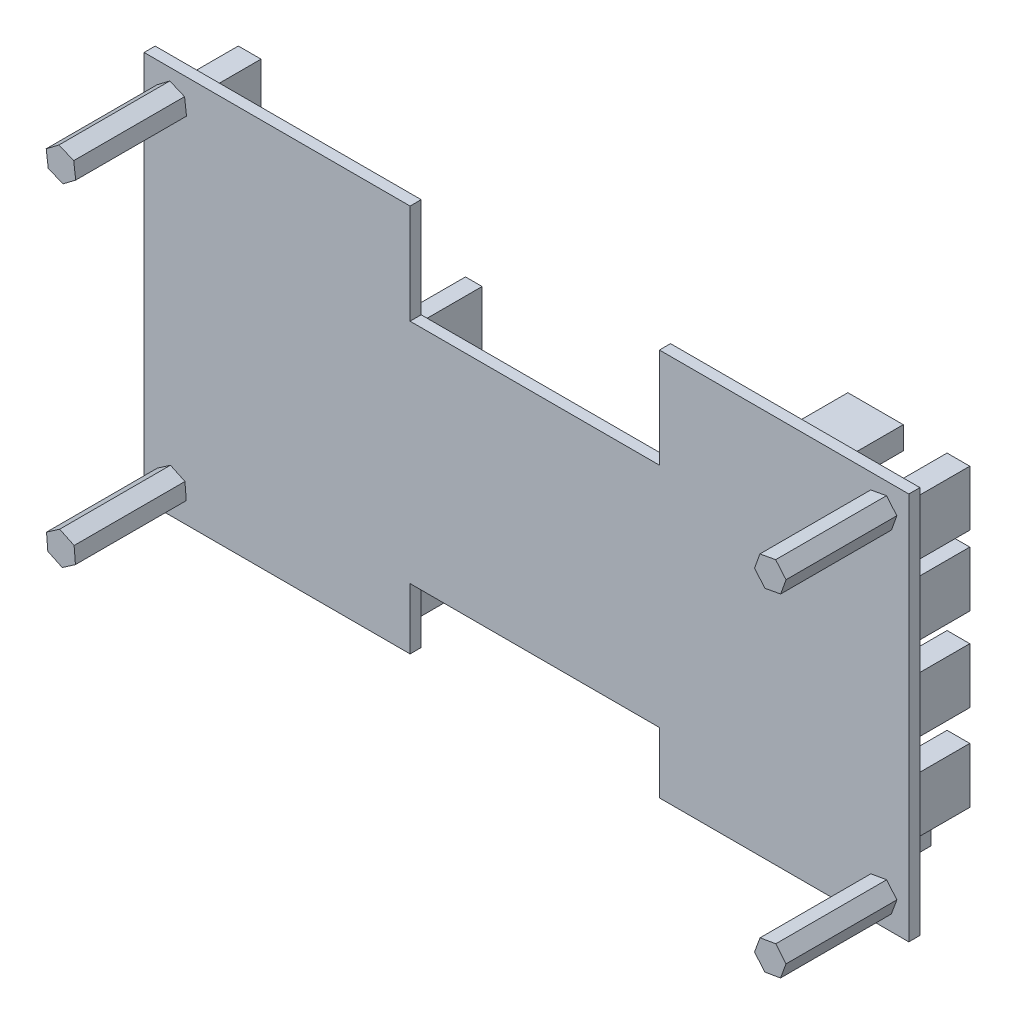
from build123d import *

# Parameters (mm, degrees)
ESQUISSE1_W             = 138
ESQUISSE1_H             = 70
BOSS_EXTRU_1_DEPTH      = 2
ESQUISSE2_W             = 45
ESQUISSE2_H             = 18
ESQUISSE2_H_2           = 11
ENL_V_MAT_EXTRU_1_DEPTH = 155.751413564
ESQUISSE3_W             = 12
ESQUISSE3_H             = 28
BOSS_EXTRU_2_DEPTH      = 15
ESQUISSE4_W             = 4.1018537
ESQUISSE4_H             = 10
ESQUISSE4_W_2           = 10
ESQUISSE4_H_2           = 4.1018537
ESQUISSE4_W_3           = 3
ESQUISSE4_H_3           = 38.780276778
BOSS_EXTRU_3_DEPTH      = 12
BOSS_EXTRU_4_DEPTH      = 20


with BuildPart() as part:
    # Esquisse1 → Boss.-Extru.1 (new body)
    with BuildSketch(Plane.XY):
        with Locations((69, -35)):
            Rectangle(ESQUISSE1_W, ESQUISSE1_H)
    extrude(amount=BOSS_EXTRU_1_DEPTH)

    # Esquisse2 → Enl_v. mat.-Extru.1 (cut, through all)
    with BuildSketch(Plane(origin=(0, 0, 0), x_dir=(-1, 0, 0), z_dir=(0, 0, -1))):
        with Locations((-70.5, -9)):
            Rectangle(ESQUISSE2_W, ESQUISSE2_H)
        with Locations((-70.5, -64.5)):
            Rectangle(ESQUISSE2_W, ESQUISSE2_H_2)
    extrude(amount=-ENL_V_MAT_EXTRU_1_DEPTH, mode=Mode.SUBTRACT)

    # Esquisse3 → Boss.-Extru.2 (add)
    with BuildSketch(Plane(origin=(0, 0, 0), x_dir=(-1, 0, 0), z_dir=(0, 0, -1))):
        with Locations((-16, -46)):
            Rectangle(ESQUISSE3_W, ESQUISSE3_H)
    extrude(amount=BOSS_EXTRU_2_DEPTH)

    # Esquisse4 → Boss.-Extru.3 (add)
    with BuildSketch(Plane(origin=(0, 0, 0), x_dir=(-1, 0, 0), z_dir=(0, 0, -1))):
        with Locations((-132.94907315, -9.154060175)):
            Rectangle(ESQUISSE4_W, ESQUISSE4_H)
        with Locations((-132.94907315, -21.7962926)):
            Rectangle(ESQUISSE4_W, ESQUISSE4_H)
        with Locations((-132.94907315, -36.891114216)):
            Rectangle(ESQUISSE4_W, ESQUISSE4_H)
        with Locations((-132.94907315, -52.478158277)):
            Rectangle(ESQUISSE4_W, ESQUISSE4_H)
        with Locations((-5.05092685, -9.490731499)):
            Rectangle(ESQUISSE4_W, ESQUISSE4_H)
        with Locations((-5.05092685, -22.288515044)):
            Rectangle(ESQUISSE4_W, ESQUISSE4_H)
        with Locations((-5.05092685, -62)):
            Rectangle(ESQUISSE4_W, ESQUISSE4_H)
        with Locations((-123, -64.94907315)):
            Rectangle(ESQUISSE4_W_2, ESQUISSE4_H_2)
        with Locations((-108, -64.94907315)):
            Rectangle(ESQUISSE4_W_2, ESQUISSE4_H_2)
        with Locations((-41.1018537, -64.94907315)):
            Rectangle(ESQUISSE4_W_2, ESQUISSE4_H_2)
        with Locations((-28.1018537, -64.94907315)):
            Rectangle(ESQUISSE4_W_2, ESQUISSE4_H_2)
        with Locations((-15.1018537, -64.94907315)):
            Rectangle(ESQUISSE4_W_2, ESQUISSE4_H_2)
        with Locations((-5.05092685, -40)):
            Rectangle(ESQUISSE4_W, ESQUISSE4_H)
        with Locations((-118, -5.719438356)):
            Rectangle(ESQUISSE4_W_2, ESQUISSE4_H_2)
        with Locations((-95.5, -39.464286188)):
            Rectangle(ESQUISSE4_W_3, ESQUISSE4_H_3)
        with Locations((-45.5, -39.464286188)):
            Rectangle(ESQUISSE4_W_3, ESQUISSE4_H_3)
    extrude(amount=BOSS_EXTRU_3_DEPTH)

    # Esquisse6 → Boss.-Extru.4 (add)
    with BuildSketch(Plane.XY.offset(2)):
        Polygon((7.66053216, -6.120224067), (7.30040858, -3.256023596), (4.63987642, -2.135799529), (2.33946784, -3.879775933), (2.69959142, -6.743976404), (5.36012358, -7.864200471), align=None)
        Polygon((134.870661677, -7.19862644), (135.839397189, -4.479272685), (133.968735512, -2.280646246), (131.129338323, -2.80137356), (130.160602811, -5.520727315), (132.031264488, -7.719353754), align=None)
        Polygon((134.848053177, -67.217663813), (135.844579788, -64.508370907), (133.99652661, -62.290707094), (131.151946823, -62.782336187), (130.155420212, -65.491629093), (132.00347339, -67.709292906), align=None)
        Polygon((7.608866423, -66.235778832), (7.374649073, -63.358544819), (4.76578265, -62.122765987), (2.391133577, -63.764221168), (2.625350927, -66.641455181), (5.23421735, -67.877234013), align=None)
    extrude(amount=BOSS_EXTRU_4_DEPTH)


solid = part.part
